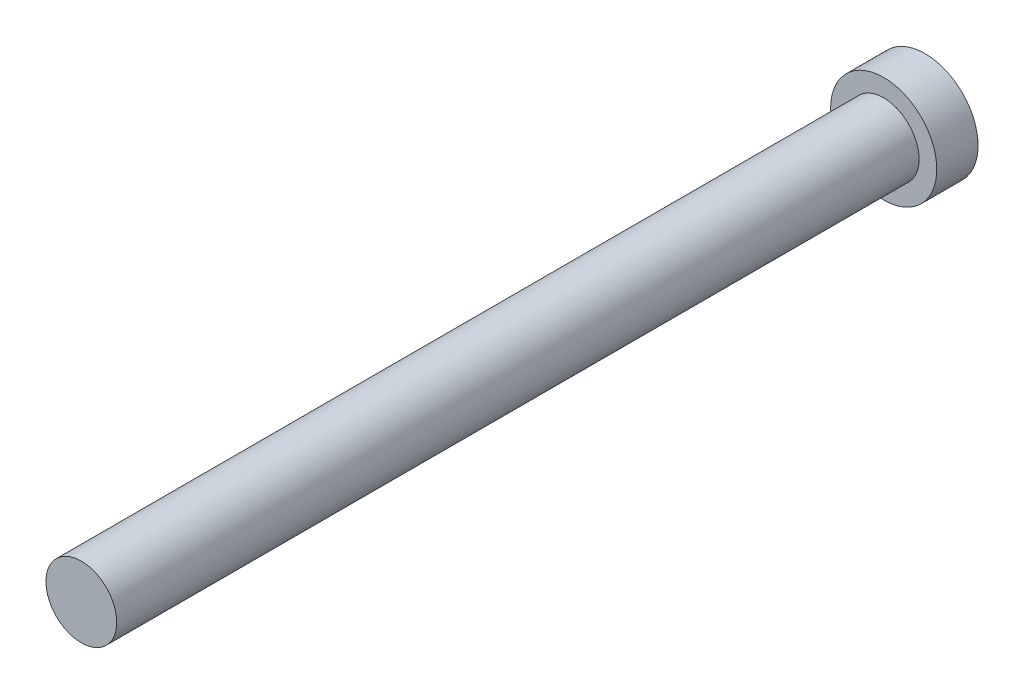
ISO-10303-21;
HEADER;
FILE_DESCRIPTION(('STEP AP214'),'2;1');
FILE_NAME('part.step','',(''),(''),'','','');
FILE_SCHEMA(('AUTOMOTIVE_DESIGN { 1 0 10303 214 1 1 1 1 }'));
ENDSEC;
DATA;
#1=APPLICATION_CONTEXT('core data for automotive mechanical design processes');
#2=APPLICATION_PROTOCOL_DEFINITION('international standard','automotive_design',2000,#1);
#3=PRODUCT_CONTEXT('',#1,'mechanical');
#4=PRODUCT('Part','Part','',(#3));
#5=PRODUCT_RELATED_PRODUCT_CATEGORY('part','',(#4));
#6=PRODUCT_DEFINITION_FORMATION('','',#4);
#7=PRODUCT_DEFINITION_CONTEXT('part definition',#1,'design');
#8=PRODUCT_DEFINITION('design','',#6,#7);
#9=PRODUCT_DEFINITION_SHAPE('','',#8);
#10=(LENGTH_UNIT() NAMED_UNIT(*) SI_UNIT(.MILLI.,.METRE.));
#11=(NAMED_UNIT(*) PLANE_ANGLE_UNIT() SI_UNIT($,.RADIAN.));
#12=(NAMED_UNIT(*) SI_UNIT($,.STERADIAN.) SOLID_ANGLE_UNIT());
#13=UNCERTAINTY_MEASURE_WITH_UNIT(LENGTH_MEASURE(1.E-05),#10,'distance_accuracy_value','');
#14=(GEOMETRIC_REPRESENTATION_CONTEXT(3) GLOBAL_UNCERTAINTY_ASSIGNED_CONTEXT((#13)) GLOBAL_UNIT_ASSIGNED_CONTEXT((#10,
#11,#12)) REPRESENTATION_CONTEXT('',''));
#15=CARTESIAN_POINT('',(0.,0.,0.));
#16=DIRECTION('',(0.,0.,1.));
#17=DIRECTION('',(1.,0.,0.));
#18=AXIS2_PLACEMENT_3D('',#15,#16,#17);
#19=CARTESIAN_POINT('',(130.,80.,-1415.7));
#20=DIRECTION('',(0.,0.,1.));
#21=DIRECTION('',(1.,0.,0.));
#22=AXIS2_PLACEMENT_3D('',#19,#20,#21);
#23=CYLINDRICAL_SURFACE('',#22,6.);
#24=CARTESIAN_POINT('',(130.,80.,0.));
#25=DIRECTION('',(0.,0.,1.));
#26=DIRECTION('',(1.,0.,0.));
#27=AXIS2_PLACEMENT_3D('',#24,#25,#26);
#28=CIRCLE('',#27,6.);
#29=CARTESIAN_POINT('',(136.,80.,0.));
#30=VERTEX_POINT('',#29);
#31=EDGE_CURVE('E10',#30,#30,#28,.T.);
#32=ORIENTED_EDGE('',*,*,#31,.F.);
#33=EDGE_LOOP('',(#32));
#34=FACE_BOUND('',#33,.T.);
#35=CARTESIAN_POINT('',(130.,80.,-136.));
#36=DIRECTION('',(0.,0.,-1.));
#37=DIRECTION('',(-1.,0.,0.));
#38=AXIS2_PLACEMENT_3D('',#35,#36,#37);
#39=CIRCLE('',#38,6.);
#40=CARTESIAN_POINT('',(124.,80.,-136.));
#41=VERTEX_POINT('',#40);
#42=EDGE_CURVE('E17',#41,#41,#39,.F.);
#43=ORIENTED_EDGE('',*,*,#42,.T.);
#44=EDGE_LOOP('',(#43));
#45=FACE_BOUND('',#44,.T.);
#46=ADVANCED_FACE('F14',(#34,#45),#23,.T.);
#47=CARTESIAN_POINT('',(130.,80.,0.));
#48=DIRECTION('',(0.,0.,1.));
#49=DIRECTION('',(1.,0.,0.));
#50=AXIS2_PLACEMENT_3D('',#47,#48,#49);
#51=PLANE('',#50);
#52=ORIENTED_EDGE('',*,*,#31,.T.);
#53=EDGE_LOOP('',(#52));
#54=FACE_BOUND('',#53,.T.);
#55=ADVANCED_FACE('F46',(#54),#51,.T.);
#56=CARTESIAN_POINT('',(130.,80.,-143.));
#57=DIRECTION('',(0.,0.,1.));
#58=DIRECTION('',(1.,0.,0.));
#59=AXIS2_PLACEMENT_3D('',#56,#57,#58);
#60=CYLINDRICAL_SURFACE('',#59,9.);
#61=CARTESIAN_POINT('',(130.,80.,-143.));
#62=DIRECTION('',(0.,0.,-1.));
#63=DIRECTION('',(-1.,0.,0.));
#64=AXIS2_PLACEMENT_3D('',#61,#62,#63);
#65=CIRCLE('',#64,9.);
#66=CARTESIAN_POINT('',(121.,80.,-143.));
#67=VERTEX_POINT('',#66);
#68=EDGE_CURVE('E24',#67,#67,#65,.F.);
#69=ORIENTED_EDGE('',*,*,#68,.T.);
#70=EDGE_LOOP('',(#69));
#71=FACE_BOUND('',#70,.T.);
#72=CARTESIAN_POINT('',(130.,80.,-136.));
#73=DIRECTION('',(0.,0.,-1.));
#74=DIRECTION('',(-1.,0.,0.));
#75=AXIS2_PLACEMENT_3D('',#72,#73,#74);
#76=CIRCLE('',#75,9.);
#77=CARTESIAN_POINT('',(121.,80.,-136.));
#78=VERTEX_POINT('',#77);
#79=EDGE_CURVE('E26',#78,#78,#76,.F.);
#80=ORIENTED_EDGE('',*,*,#79,.F.);
#81=EDGE_LOOP('',(#80));
#82=FACE_BOUND('',#81,.T.);
#83=ADVANCED_FACE('F32',(#71,#82),#60,.T.);
#84=CARTESIAN_POINT('',(198.,-100.,-136.));
#85=DIRECTION('',(0.,0.,-1.));
#86=DIRECTION('',(-1.,0.,0.));
#87=AXIS2_PLACEMENT_3D('',#84,#85,#86);
#88=PLANE('',#87);
#89=ORIENTED_EDGE('',*,*,#42,.F.);
#90=EDGE_LOOP('',(#89));
#91=FACE_BOUND('',#90,.T.);
#92=ORIENTED_EDGE('',*,*,#79,.T.);
#93=EDGE_LOOP('',(#92));
#94=FACE_BOUND('',#93,.T.);
#95=ADVANCED_FACE('F37',(#91,#94),#88,.F.);
#96=CARTESIAN_POINT('',(198.,-100.,-143.));
#97=DIRECTION('',(0.,0.,-1.));
#98=DIRECTION('',(-1.,0.,0.));
#99=AXIS2_PLACEMENT_3D('',#96,#97,#98);
#100=PLANE('',#99);
#101=ORIENTED_EDGE('',*,*,#68,.F.);
#102=EDGE_LOOP('',(#101));
#103=FACE_BOUND('',#102,.T.);
#104=ADVANCED_FACE('F35',(#103),#100,.T.);
#105=CLOSED_SHELL('',(#46,#55,#83,#95,#104));
#106=MANIFOLD_SOLID_BREP('B1',#105);
#107=ADVANCED_BREP_SHAPE_REPRESENTATION('',(#18,#106),#14);
#108=SHAPE_DEFINITION_REPRESENTATION(#9,#107);
ENDSEC;
END-ISO-10303-21;
